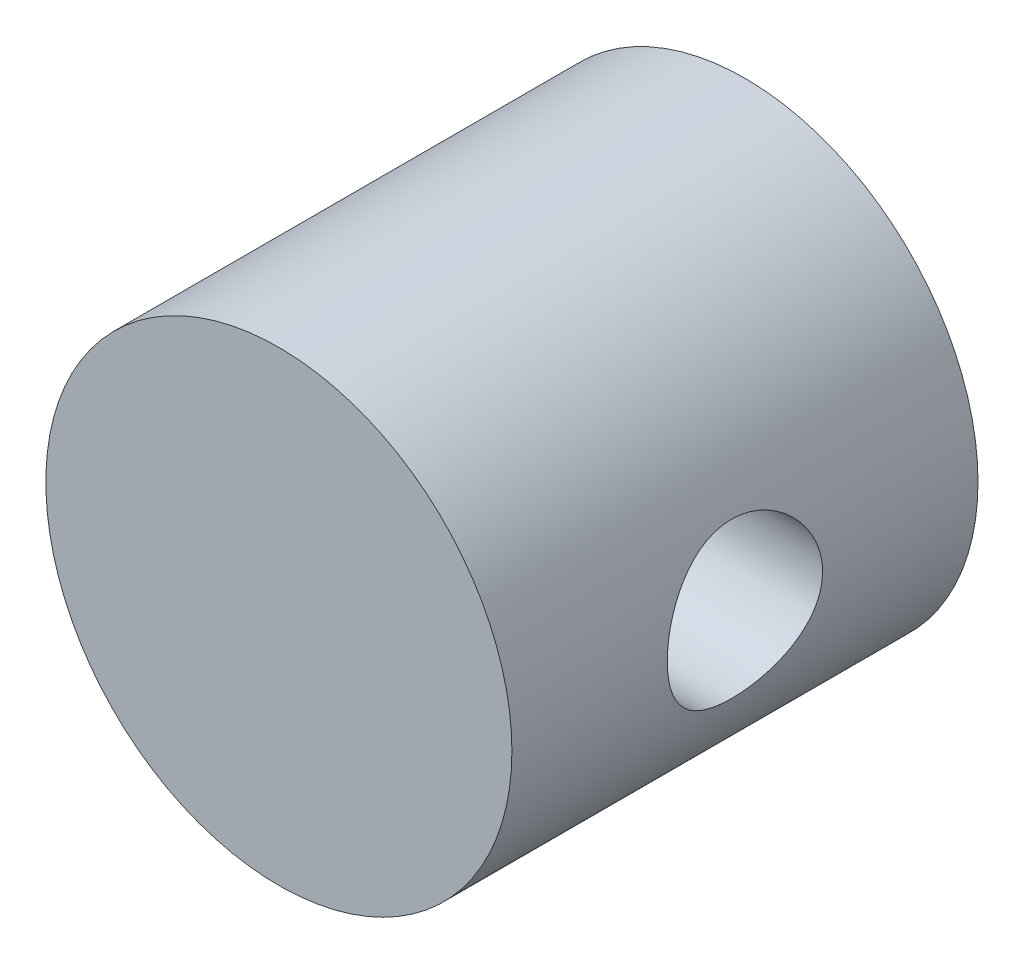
from build123d import *

# Parameters (mm, degrees)
ESQUISSE1_R               = 7.5
EXTRUSION1_DEPTH          = 15
TROU_TARAUD_M6X1_01_D     = 5
TROU_TARAUD_M6X1_01_DEPTH = 15
TROU_TARAUD_M6X1_01_TIP   = 1.502151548


with BuildPart() as part:
    # Esquisse1 → Extrusion1 (new body)
    with BuildSketch(Plane.XY):
        Circle(ESQUISSE1_R)
    extrude(amount=EXTRUSION1_DEPTH)

    # Trou taraud_ M6x1.01
    with Locations(Plane(origin=(7.5, 0, 0), x_dir=(0, 0, -1), z_dir=(1, 0, 0))):
        with Locations((-7.5, 0)):
            Hole(TROU_TARAUD_M6X1_01_D / 2, depth=TROU_TARAUD_M6X1_01_DEPTH)
            with Locations((0, 0, -(TROU_TARAUD_M6X1_01_DEPTH + TROU_TARAUD_M6X1_01_TIP / 2))):  # 118° drill point
                Cone(0, TROU_TARAUD_M6X1_01_D / 2, TROU_TARAUD_M6X1_01_TIP, mode=Mode.SUBTRACT)


solid = part.part
